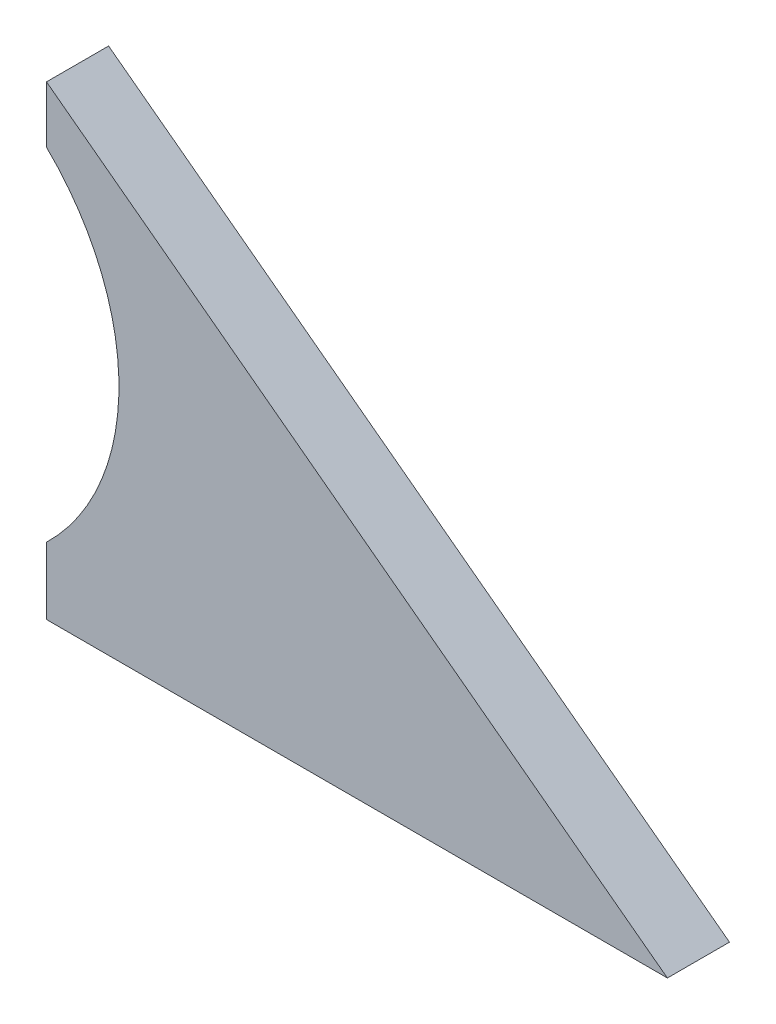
from build123d import *

# Parameters (mm, degrees)
EXTRUDE_1_DEPTH = 6


with BuildPart() as part:
    # Sketch 1 → Extrude 1 (new body)
    with BuildSketch(Plane.XY):
        with BuildLine():
            Line((0, 45), (0, 39.522711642))
            ThreePointArc((0, 39.522711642), (7, 23), (0, 6.477288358))
            Line((0, 6.477288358), (0, 0))
            Line((0, 0), (60, 0))
            Line((60, 0), (0, 45))
        make_face()
    extrude(amount=EXTRUDE_1_DEPTH)


solid = part.part
